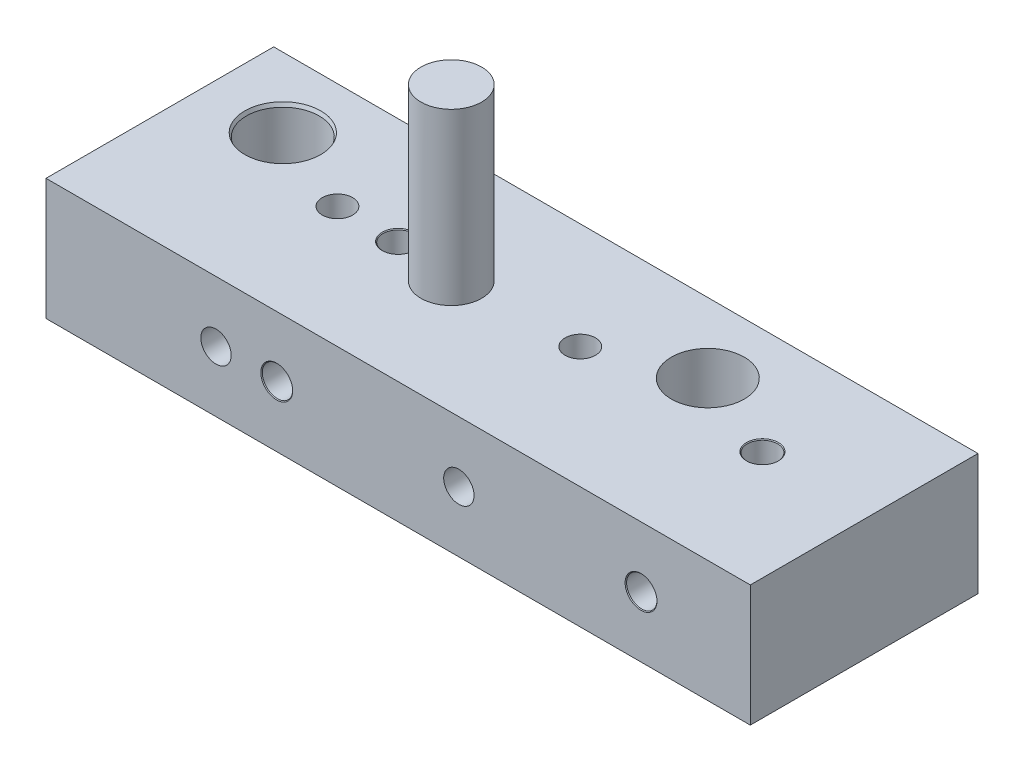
ISO-10303-21;
HEADER;
FILE_DESCRIPTION(('STEP AP214'),'2;1');
FILE_NAME('part.step','',(''),(''),'','','');
FILE_SCHEMA(('AUTOMOTIVE_DESIGN { 1 0 10303 214 1 1 1 1 }'));
ENDSEC;
DATA;
#1=APPLICATION_CONTEXT('core data for automotive mechanical design processes');
#2=APPLICATION_PROTOCOL_DEFINITION('international standard','automotive_design',2000,#1);
#3=PRODUCT_CONTEXT('',#1,'mechanical');
#4=PRODUCT('Part','Part','',(#3));
#5=PRODUCT_RELATED_PRODUCT_CATEGORY('part','',(#4));
#6=PRODUCT_DEFINITION_FORMATION('','',#4);
#7=PRODUCT_DEFINITION_CONTEXT('part definition',#1,'design');
#8=PRODUCT_DEFINITION('design','',#6,#7);
#9=PRODUCT_DEFINITION_SHAPE('','',#8);
#10=(LENGTH_UNIT() NAMED_UNIT(*) SI_UNIT(.MILLI.,.METRE.));
#11=(NAMED_UNIT(*) PLANE_ANGLE_UNIT() SI_UNIT($,.RADIAN.));
#12=(NAMED_UNIT(*) SI_UNIT($,.STERADIAN.) SOLID_ANGLE_UNIT());
#13=UNCERTAINTY_MEASURE_WITH_UNIT(LENGTH_MEASURE(1.E-05),#10,'distance_accuracy_value','');
#14=(GEOMETRIC_REPRESENTATION_CONTEXT(3) GLOBAL_UNCERTAINTY_ASSIGNED_CONTEXT((#13)) GLOBAL_UNIT_ASSIGNED_CONTEXT((#10,
#11,#12)) REPRESENTATION_CONTEXT('',''));
#15=CARTESIAN_POINT('',(0.,0.,0.));
#16=DIRECTION('',(0.,0.,1.));
#17=DIRECTION('',(1.,0.,0.));
#18=AXIS2_PLACEMENT_3D('',#15,#16,#17);
#19=CARTESIAN_POINT('',(0.,20.,-37.5));
#20=DIRECTION('',(0.,-1.,0.));
#21=DIRECTION('',(0.,0.,-1.));
#22=AXIS2_PLACEMENT_3D('',#19,#20,#21);
#23=PLANE('',#22);
#24=CARTESIAN_POINT('',(83.,20.,-26.));
#25=DIRECTION('',(0.,-1.,0.));
#26=DIRECTION('',(0.,0.,-1.));
#27=AXIS2_PLACEMENT_3D('',#24,#25,#26);
#28=CIRCLE('',#27,6.);
#29=CARTESIAN_POINT('',(83.,20.,-32.));
#30=VERTEX_POINT('',#29);
#31=EDGE_CURVE('E9178',#30,#30,#28,.T.);
#32=ORIENTED_EDGE('',*,*,#31,.T.);
#33=EDGE_LOOP('',(#32));
#34=FACE_BOUND('',#33,.T.);
#35=DIRECTION('',(0.,0.,1.));
#36=VECTOR('',#35,1.);
#37=CARTESIAN_POINT('',(0.,20.,0.));
#38=LINE('',#37,#36);
#39=CARTESIAN_POINT('',(0.,20.,-37.5));
#40=VERTEX_POINT('',#39);
#41=CARTESIAN_POINT('',(0.,20.,0.));
#42=VERTEX_POINT('',#41);
#43=EDGE_CURVE('E9306',#40,#42,#38,.T.);
#44=ORIENTED_EDGE('',*,*,#43,.T.);
#45=DIRECTION('',(1.,0.,0.));
#46=VECTOR('',#45,1.);
#47=CARTESIAN_POINT('',(0.,20.,0.));
#48=LINE('',#47,#46);
#49=CARTESIAN_POINT('',(116.,20.,0.));
#50=VERTEX_POINT('',#49);
#51=EDGE_CURVE('E9304',#42,#50,#48,.T.);
#52=ORIENTED_EDGE('',*,*,#51,.T.);
#53=DIRECTION('',(0.,0.,-1.));
#54=VECTOR('',#53,1.);
#55=CARTESIAN_POINT('',(116.,20.,0.));
#56=LINE('',#55,#54);
#57=CARTESIAN_POINT('',(116.,20.,-37.5));
#58=VERTEX_POINT('',#57);
#59=EDGE_CURVE('E9302',#50,#58,#56,.T.);
#60=ORIENTED_EDGE('',*,*,#59,.T.);
#61=DIRECTION('',(-1.,0.,0.));
#62=VECTOR('',#61,1.);
#63=CARTESIAN_POINT('',(0.,20.,-37.5));
#64=LINE('',#63,#62);
#65=EDGE_CURVE('E9300',#58,#40,#64,.T.);
#66=ORIENTED_EDGE('',*,*,#65,.T.);
#67=EDGE_LOOP('',(#44,#52,#60,#66));
#68=FACE_BOUND('',#67,.T.);
#69=CARTESIAN_POINT('',(13.,20.,-26.));
#70=DIRECTION('',(0.,-1.,0.));
#71=DIRECTION('',(0.,0.,-1.));
#72=AXIS2_PLACEMENT_3D('',#69,#70,#71);
#73=CIRCLE('',#72,6.25);
#74=CARTESIAN_POINT('',(13.,20.,-32.25));
#75=VERTEX_POINT('',#74);
#76=EDGE_CURVE('E9327',#75,#75,#73,.T.);
#77=ORIENTED_EDGE('',*,*,#76,.T.);
#78=EDGE_LOOP('',(#77));
#79=FACE_BOUND('',#78,.T.);
#80=CARTESIAN_POINT('',(28.,20.,-20.));
#81=DIRECTION('',(0.,-1.,0.));
#82=DIRECTION('',(0.,0.,-1.));
#83=AXIS2_PLACEMENT_3D('',#80,#81,#82);
#84=CIRCLE('',#83,2.5);
#85=CARTESIAN_POINT('',(28.,20.,-22.5));
#86=VERTEX_POINT('',#85);
#87=EDGE_CURVE('E9333',#86,#86,#84,.T.);
#88=ORIENTED_EDGE('',*,*,#87,.T.);
#89=EDGE_LOOP('',(#88));
#90=FACE_BOUND('',#89,.T.);
#91=CARTESIAN_POINT('',(68.,20.,-20.));
#92=DIRECTION('',(0.,-1.,0.));
#93=DIRECTION('',(0.,0.,-1.));
#94=AXIS2_PLACEMENT_3D('',#91,#92,#93);
#95=CIRCLE('',#94,2.5);
#96=CARTESIAN_POINT('',(68.,20.,-22.5));
#97=VERTEX_POINT('',#96);
#98=EDGE_CURVE('E9339',#97,#97,#95,.T.);
#99=ORIENTED_EDGE('',*,*,#98,.T.);
#100=EDGE_LOOP('',(#99));
#101=FACE_BOUND('',#100,.T.);
#102=CARTESIAN_POINT('',(38.,20.,-20.));
#103=DIRECTION('',(0.,-1.,0.));
#104=DIRECTION('',(0.,0.,-1.));
#105=AXIS2_PLACEMENT_3D('',#102,#103,#104);
#106=CIRCLE('',#105,2.625);
#107=CARTESIAN_POINT('',(38.,20.,-22.625));
#108=VERTEX_POINT('',#107);
#109=EDGE_CURVE('E9351',#108,#108,#106,.T.);
#110=ORIENTED_EDGE('',*,*,#109,.T.);
#111=EDGE_LOOP('',(#110));
#112=FACE_BOUND('',#111,.T.);
#113=CARTESIAN_POINT('',(98.,20.,-20.));
#114=DIRECTION('',(0.,-1.,0.));
#115=DIRECTION('',(0.,0.,-1.));
#116=AXIS2_PLACEMENT_3D('',#113,#114,#115);
#117=CIRCLE('',#116,2.62499999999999);
#118=CARTESIAN_POINT('',(98.,20.,-22.625));
#119=VERTEX_POINT('',#118);
#120=EDGE_CURVE('E9363',#119,#119,#117,.T.);
#121=ORIENTED_EDGE('',*,*,#120,.T.);
#122=EDGE_LOOP('',(#121));
#123=FACE_BOUND('',#122,.T.);
#124=CARTESIAN_POINT('',(48.,20.,-18.75));
#125=DIRECTION('',(0.,-1.,0.));
#126=DIRECTION('',(0.,0.,-1.));
#127=AXIS2_PLACEMENT_3D('',#124,#125,#126);
#128=CIRCLE('',#127,5.);
#129=CARTESIAN_POINT('',(48.,20.,-23.75));
#130=VERTEX_POINT('',#129);
#131=EDGE_CURVE('E11',#130,#130,#128,.F.);
#132=ORIENTED_EDGE('',*,*,#131,.F.);
#133=EDGE_LOOP('',(#132));
#134=FACE_BOUND('',#133,.T.);
#135=ADVANCED_FACE('F9174',(#34,#68,#79,#90,#101,#112,#123,#134),#23,.F.);
#136=CARTESIAN_POINT('',(68.,0.,-20.));
#137=DIRECTION('',(0.,-1.,0.));
#138=DIRECTION('',(0.,0.,-1.));
#139=AXIS2_PLACEMENT_3D('',#136,#137,#138);
#140=CYLINDRICAL_SURFACE('',#139,2.5);
#141=CARTESIAN_POINT('',(68.,0.,-20.));
#142=DIRECTION('',(0.,-1.,0.));
#143=DIRECTION('',(0.,0.,-1.));
#144=AXIS2_PLACEMENT_3D('',#141,#142,#143);
#145=CIRCLE('',#144,2.49999999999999);
#146=CARTESIAN_POINT('',(68.,0.,-22.5));
#147=VERTEX_POINT('',#146);
#148=EDGE_CURVE('E9336',#147,#147,#145,.T.);
#149=ORIENTED_EDGE('',*,*,#148,.T.);
#150=EDGE_LOOP('',(#149));
#151=FACE_BOUND('',#150,.T.);
#152=CARTESIAN_POINT('',(68.,10.,-20.));
#153=DIRECTION('',(0.,-0.707106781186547,-0.707106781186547));
#154=DIRECTION('',(0.,-0.707106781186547,0.707106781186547));
#155=AXIS2_PLACEMENT_3D('',#152,#153,#154);
#156=ELLIPSE('',#155,3.53553390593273,2.49999999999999);
#157=CARTESIAN_POINT('',(65.5,10.,-20.));
#158=VERTEX_POINT('',#157);
#159=CARTESIAN_POINT('',(70.5,10.,-20.));
#160=VERTEX_POINT('',#159);
#161=EDGE_CURVE('E9189',#158,#160,#156,.F.);
#162=ORIENTED_EDGE('',*,*,#161,.T.);
#163=CARTESIAN_POINT('',(68.,10.,-20.));
#164=DIRECTION('',(0.,-0.707106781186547,0.707106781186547));
#165=DIRECTION('',(0.,-0.707106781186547,-0.707106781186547));
#166=AXIS2_PLACEMENT_3D('',#163,#164,#165);
#167=ELLIPSE('',#166,3.53553390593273,2.49999999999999);
#168=EDGE_CURVE('E9183',#160,#158,#167,.F.);
#169=ORIENTED_EDGE('',*,*,#168,.T.);
#170=EDGE_LOOP('',(#162,#169));
#171=FACE_BOUND('',#170,.T.);
#172=ADVANCED_FACE('F9252',(#151,#171),#140,.F.);
#173=CARTESIAN_POINT('',(28.,0.,-20.));
#174=DIRECTION('',(0.,-1.,0.));
#175=DIRECTION('',(0.,0.,-1.));
#176=AXIS2_PLACEMENT_3D('',#173,#174,#175);
#177=CYLINDRICAL_SURFACE('',#176,2.49999999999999);
#178=CARTESIAN_POINT('',(28.,0.,-20.));
#179=DIRECTION('',(0.,-1.,0.));
#180=DIRECTION('',(0.,0.,-1.));
#181=AXIS2_PLACEMENT_3D('',#178,#179,#180);
#182=CIRCLE('',#181,2.49999999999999);
#183=CARTESIAN_POINT('',(28.,0.,-22.5));
#184=VERTEX_POINT('',#183);
#185=EDGE_CURVE('E9330',#184,#184,#182,.T.);
#186=ORIENTED_EDGE('',*,*,#185,.T.);
#187=EDGE_LOOP('',(#186));
#188=FACE_BOUND('',#187,.T.);
#189=CARTESIAN_POINT('',(28.,10.,-20.));
#190=DIRECTION('',(0.,-0.707106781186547,-0.707106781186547));
#191=DIRECTION('',(0.,-0.707106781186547,0.707106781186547));
#192=AXIS2_PLACEMENT_3D('',#189,#190,#191);
#193=ELLIPSE('',#192,3.53553390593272,2.49999999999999);
#194=CARTESIAN_POINT('',(25.5,10.,-20.));
#195=VERTEX_POINT('',#194);
#196=CARTESIAN_POINT('',(30.5,10.,-20.));
#197=VERTEX_POINT('',#196);
#198=EDGE_CURVE('E9196',#195,#197,#193,.F.);
#199=ORIENTED_EDGE('',*,*,#198,.T.);
#200=CARTESIAN_POINT('',(28.,10.,-20.));
#201=DIRECTION('',(0.,-0.707106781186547,0.707106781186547));
#202=DIRECTION('',(0.,-0.707106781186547,-0.707106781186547));
#203=AXIS2_PLACEMENT_3D('',#200,#201,#202);
#204=ELLIPSE('',#203,3.53553390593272,2.49999999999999);
#205=EDGE_CURVE('E9250',#197,#195,#204,.F.);
#206=ORIENTED_EDGE('',*,*,#205,.T.);
#207=EDGE_LOOP('',(#199,#206));
#208=FACE_BOUND('',#207,.T.);
#209=ADVANCED_FACE('F9544',(#188,#208),#177,.F.);
#210=CARTESIAN_POINT('',(98.,0.,-20.));
#211=DIRECTION('',(0.,-1.,0.));
#212=DIRECTION('',(0.,0.,-1.));
#213=AXIS2_PLACEMENT_3D('',#210,#211,#212);
#214=CYLINDRICAL_SURFACE('',#213,2.5);
#215=CARTESIAN_POINT('',(98.,0.125000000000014,-20.));
#216=DIRECTION('',(0.,-1.,0.));
#217=DIRECTION('',(0.,0.,-1.));
#218=AXIS2_PLACEMENT_3D('',#215,#216,#217);
#219=CIRCLE('',#218,2.49999999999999);
#220=CARTESIAN_POINT('',(98.,0.125000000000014,-22.5));
#221=VERTEX_POINT('',#220);
#222=EDGE_CURVE('E9357',#221,#221,#219,.T.);
#223=ORIENTED_EDGE('',*,*,#222,.T.);
#224=EDGE_LOOP('',(#223));
#225=FACE_BOUND('',#224,.T.);
#226=CARTESIAN_POINT('',(98.,10.,-20.));
#227=DIRECTION('',(0.,-0.707106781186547,-0.707106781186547));
#228=DIRECTION('',(0.,-0.707106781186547,0.707106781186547));
#229=AXIS2_PLACEMENT_3D('',#226,#227,#228);
#230=ELLIPSE('',#229,3.53553390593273,2.5);
#231=CARTESIAN_POINT('',(95.5,10.,-20.));
#232=VERTEX_POINT('',#231);
#233=CARTESIAN_POINT('',(100.5,10.,-20.));
#234=VERTEX_POINT('',#233);
#235=EDGE_CURVE('E9275',#232,#234,#230,.F.);
#236=ORIENTED_EDGE('',*,*,#235,.T.);
#237=CARTESIAN_POINT('',(98.,10.,-20.));
#238=DIRECTION('',(0.,-0.707106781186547,0.707106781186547));
#239=DIRECTION('',(0.,-0.707106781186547,-0.707106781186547));
#240=AXIS2_PLACEMENT_3D('',#237,#238,#239);
#241=ELLIPSE('',#240,3.53553390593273,2.5);
#242=EDGE_CURVE('E9266',#234,#232,#241,.F.);
#243=ORIENTED_EDGE('',*,*,#242,.T.);
#244=EDGE_LOOP('',(#236,#243));
#245=FACE_BOUND('',#244,.T.);
#246=ADVANCED_FACE('F9520',(#225,#245),#214,.F.);
#247=CARTESIAN_POINT('',(38.,0.,-20.));
#248=DIRECTION('',(0.,-1.,0.));
#249=DIRECTION('',(0.,0.,-1.));
#250=AXIS2_PLACEMENT_3D('',#247,#248,#249);
#251=CYLINDRICAL_SURFACE('',#250,2.5);
#252=CARTESIAN_POINT('',(38.,0.125,-20.));
#253=DIRECTION('',(0.,-1.,0.));
#254=DIRECTION('',(0.,0.,-1.));
#255=AXIS2_PLACEMENT_3D('',#252,#253,#254);
#256=CIRCLE('',#255,2.5);
#257=CARTESIAN_POINT('',(38.,0.125,-22.5));
#258=VERTEX_POINT('',#257);
#259=EDGE_CURVE('E9345',#258,#258,#256,.T.);
#260=ORIENTED_EDGE('',*,*,#259,.T.);
#261=EDGE_LOOP('',(#260));
#262=FACE_BOUND('',#261,.T.);
#263=CARTESIAN_POINT('',(38.,10.,-20.));
#264=DIRECTION('',(0.,-0.707106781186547,-0.707106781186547));
#265=DIRECTION('',(0.,-0.707106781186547,0.707106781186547));
#266=AXIS2_PLACEMENT_3D('',#263,#264,#265);
#267=ELLIPSE('',#266,3.53553390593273,2.49999999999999);
#268=CARTESIAN_POINT('',(35.5,10.,-20.));
#269=VERTEX_POINT('',#268);
#270=CARTESIAN_POINT('',(40.5,10.,-20.));
#271=VERTEX_POINT('',#270);
#272=EDGE_CURVE('E9286',#269,#271,#267,.F.);
#273=ORIENTED_EDGE('',*,*,#272,.T.);
#274=CARTESIAN_POINT('',(38.,10.,-20.));
#275=DIRECTION('',(0.,-0.707106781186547,0.707106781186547));
#276=DIRECTION('',(0.,-0.707106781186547,-0.707106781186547));
#277=AXIS2_PLACEMENT_3D('',#274,#275,#276);
#278=ELLIPSE('',#277,3.53553390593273,2.49999999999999);
#279=EDGE_CURVE('E9277',#271,#269,#278,.F.);
#280=ORIENTED_EDGE('',*,*,#279,.T.);
#281=EDGE_LOOP('',(#273,#280));
#282=FACE_BOUND('',#281,.T.);
#283=ADVANCED_FACE('F9533',(#262,#282),#251,.F.);
#284=CARTESIAN_POINT('',(0.,20.,0.));
#285=DIRECTION('',(1.,0.,0.));
#286=DIRECTION('',(0.,0.,-1.));
#287=AXIS2_PLACEMENT_3D('',#284,#285,#286);
#288=PLANE('',#287);
#289=DIRECTION('',(0.,0.,1.));
#290=VECTOR('',#289,1.);
#291=CARTESIAN_POINT('',(0.,0.,0.));
#292=LINE('',#291,#290);
#293=CARTESIAN_POINT('',(0.,0.,-37.5));
#294=VERTEX_POINT('',#293);
#295=CARTESIAN_POINT('',(0.,0.,0.));
#296=VERTEX_POINT('',#295);
#297=EDGE_CURVE('E9315',#294,#296,#292,.T.);
#298=ORIENTED_EDGE('',*,*,#297,.T.);
#299=DIRECTION('',(0.,-1.,0.));
#300=VECTOR('',#299,1.);
#301=CARTESIAN_POINT('',(0.,20.,0.));
#302=LINE('',#301,#300);
#303=EDGE_CURVE('E9288',#42,#296,#302,.T.);
#304=ORIENTED_EDGE('',*,*,#303,.F.);
#305=ORIENTED_EDGE('',*,*,#43,.F.);
#306=DIRECTION('',(0.,-1.,0.));
#307=VECTOR('',#306,1.);
#308=CARTESIAN_POINT('',(0.,20.,-37.5));
#309=LINE('',#308,#307);
#310=EDGE_CURVE('E9297',#40,#294,#309,.T.);
#311=ORIENTED_EDGE('',*,*,#310,.T.);
#312=EDGE_LOOP('',(#298,#304,#305,#311));
#313=FACE_BOUND('',#312,.T.);
#314=ADVANCED_FACE('F9176',(#313),#288,.F.);
#315=CARTESIAN_POINT('',(0.,20.,0.));
#316=DIRECTION('',(0.,0.,-1.));
#317=DIRECTION('',(-1.,0.,0.));
#318=AXIS2_PLACEMENT_3D('',#315,#316,#317);
#319=PLANE('',#318);
#320=CARTESIAN_POINT('',(68.,10.,0.));
#321=DIRECTION('',(0.,0.,1.));
#322=DIRECTION('',(1.,0.,0.));
#323=AXIS2_PLACEMENT_3D('',#320,#321,#322);
#324=CIRCLE('',#323,2.49999999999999);
#325=CARTESIAN_POINT('',(70.5,10.,0.));
#326=VERTEX_POINT('',#325);
#327=EDGE_CURVE('E9396',#326,#326,#324,.T.);
#328=ORIENTED_EDGE('',*,*,#327,.F.);
#329=EDGE_LOOP('',(#328));
#330=FACE_BOUND('',#329,.T.);
#331=CARTESIAN_POINT('',(28.,10.,0.));
#332=DIRECTION('',(0.,0.,1.));
#333=DIRECTION('',(1.,0.,0.));
#334=AXIS2_PLACEMENT_3D('',#331,#332,#333);
#335=CIRCLE('',#334,2.49999999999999);
#336=CARTESIAN_POINT('',(30.5,10.,0.));
#337=VERTEX_POINT('',#336);
#338=EDGE_CURVE('E9390',#337,#337,#335,.T.);
#339=ORIENTED_EDGE('',*,*,#338,.F.);
#340=EDGE_LOOP('',(#339));
#341=FACE_BOUND('',#340,.T.);
#342=CARTESIAN_POINT('',(98.,10.,0.));
#343=DIRECTION('',(0.,0.,1.));
#344=DIRECTION('',(1.,0.,0.));
#345=AXIS2_PLACEMENT_3D('',#342,#343,#344);
#346=CIRCLE('',#345,2.625);
#347=CARTESIAN_POINT('',(100.625,10.,0.));
#348=VERTEX_POINT('',#347);
#349=EDGE_CURVE('E9378',#348,#348,#346,.T.);
#350=ORIENTED_EDGE('',*,*,#349,.F.);
#351=EDGE_LOOP('',(#350));
#352=FACE_BOUND('',#351,.T.);
#353=CARTESIAN_POINT('',(38.,10.,0.));
#354=DIRECTION('',(0.,0.,1.));
#355=DIRECTION('',(1.,0.,0.));
#356=AXIS2_PLACEMENT_3D('',#353,#354,#355);
#357=CIRCLE('',#356,2.625);
#358=CARTESIAN_POINT('',(40.625,10.,0.));
#359=VERTEX_POINT('',#358);
#360=EDGE_CURVE('E9366',#359,#359,#357,.T.);
#361=ORIENTED_EDGE('',*,*,#360,.F.);
#362=EDGE_LOOP('',(#361));
#363=FACE_BOUND('',#362,.T.);
#364=DIRECTION('',(1.,0.,0.));
#365=VECTOR('',#364,1.);
#366=CARTESIAN_POINT('',(0.,0.,0.));
#367=LINE('',#366,#365);
#368=CARTESIAN_POINT('',(116.,0.,0.));
#369=VERTEX_POINT('',#368);
#370=EDGE_CURVE('E9313',#296,#369,#367,.T.);
#371=ORIENTED_EDGE('',*,*,#370,.T.);
#372=DIRECTION('',(0.,-1.,0.));
#373=VECTOR('',#372,1.);
#374=CARTESIAN_POINT('',(116.,20.,0.));
#375=LINE('',#374,#373);
#376=EDGE_CURVE('E9291',#50,#369,#375,.T.);
#377=ORIENTED_EDGE('',*,*,#376,.F.);
#378=ORIENTED_EDGE('',*,*,#51,.F.);
#379=ORIENTED_EDGE('',*,*,#303,.T.);
#380=EDGE_LOOP('',(#371,#377,#378,#379));
#381=FACE_BOUND('',#380,.T.);
#382=ADVANCED_FACE('F9445',(#330,#341,#352,#363,#381),#319,.F.);
#383=CARTESIAN_POINT('',(116.,20.,0.));
#384=DIRECTION('',(-1.,0.,0.));
#385=DIRECTION('',(0.,0.,1.));
#386=AXIS2_PLACEMENT_3D('',#383,#384,#385);
#387=PLANE('',#386);
#388=DIRECTION('',(0.,0.,-1.));
#389=VECTOR('',#388,1.);
#390=CARTESIAN_POINT('',(116.,0.,0.));
#391=LINE('',#390,#389);
#392=CARTESIAN_POINT('',(116.,0.,-37.5));
#393=VERTEX_POINT('',#392);
#394=EDGE_CURVE('E9311',#369,#393,#391,.T.);
#395=ORIENTED_EDGE('',*,*,#394,.T.);
#396=DIRECTION('',(0.,-1.,0.));
#397=VECTOR('',#396,1.);
#398=CARTESIAN_POINT('',(116.,20.,-37.5));
#399=LINE('',#398,#397);
#400=EDGE_CURVE('E9294',#58,#393,#399,.T.);
#401=ORIENTED_EDGE('',*,*,#400,.F.);
#402=ORIENTED_EDGE('',*,*,#59,.F.);
#403=ORIENTED_EDGE('',*,*,#376,.T.);
#404=EDGE_LOOP('',(#395,#401,#402,#403));
#405=FACE_BOUND('',#404,.T.);
#406=ADVANCED_FACE('F9442',(#405),#387,.F.);
#407=CARTESIAN_POINT('',(0.,20.,-37.5));
#408=DIRECTION('',(0.,0.,1.));
#409=DIRECTION('',(1.,0.,0.));
#410=AXIS2_PLACEMENT_3D('',#407,#408,#409);
#411=PLANE('',#410);
#412=CARTESIAN_POINT('',(68.,10.,-37.5));
#413=DIRECTION('',(0.,0.,1.));
#414=DIRECTION('',(1.,0.,0.));
#415=AXIS2_PLACEMENT_3D('',#412,#413,#414);
#416=CIRCLE('',#415,2.49999999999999);
#417=CARTESIAN_POINT('',(70.5,10.,-37.5));
#418=VERTEX_POINT('',#417);
#419=EDGE_CURVE('E9399',#418,#418,#416,.T.);
#420=ORIENTED_EDGE('',*,*,#419,.T.);
#421=EDGE_LOOP('',(#420));
#422=FACE_BOUND('',#421,.T.);
#423=CARTESIAN_POINT('',(28.,10.,-37.5));
#424=DIRECTION('',(0.,0.,1.));
#425=DIRECTION('',(1.,0.,0.));
#426=AXIS2_PLACEMENT_3D('',#423,#424,#425);
#427=CIRCLE('',#426,2.49999999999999);
#428=CARTESIAN_POINT('',(30.5,10.,-37.5));
#429=VERTEX_POINT('',#428);
#430=EDGE_CURVE('E9393',#429,#429,#427,.T.);
#431=ORIENTED_EDGE('',*,*,#430,.T.);
#432=EDGE_LOOP('',(#431));
#433=FACE_BOUND('',#432,.T.);
#434=CARTESIAN_POINT('',(98.,10.,-37.5));
#435=DIRECTION('',(0.,0.,1.));
#436=DIRECTION('',(1.,0.,0.));
#437=AXIS2_PLACEMENT_3D('',#434,#435,#436);
#438=CIRCLE('',#437,2.62499999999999);
#439=CARTESIAN_POINT('',(100.625,10.,-37.5));
#440=VERTEX_POINT('',#439);
#441=EDGE_CURVE('E9387',#440,#440,#438,.T.);
#442=ORIENTED_EDGE('',*,*,#441,.T.);
#443=EDGE_LOOP('',(#442));
#444=FACE_BOUND('',#443,.T.);
#445=CARTESIAN_POINT('',(38.,10.,-37.5));
#446=DIRECTION('',(0.,0.,1.));
#447=DIRECTION('',(1.,0.,0.));
#448=AXIS2_PLACEMENT_3D('',#445,#446,#447);
#449=CIRCLE('',#448,2.62499999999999);
#450=CARTESIAN_POINT('',(40.625,10.,-37.5));
#451=VERTEX_POINT('',#450);
#452=EDGE_CURVE('E9375',#451,#451,#449,.T.);
#453=ORIENTED_EDGE('',*,*,#452,.T.);
#454=EDGE_LOOP('',(#453));
#455=FACE_BOUND('',#454,.T.);
#456=DIRECTION('',(-1.,0.,0.));
#457=VECTOR('',#456,1.);
#458=CARTESIAN_POINT('',(0.,0.,-37.5));
#459=LINE('',#458,#457);
#460=EDGE_CURVE('E9309',#393,#294,#459,.T.);
#461=ORIENTED_EDGE('',*,*,#460,.T.);
#462=ORIENTED_EDGE('',*,*,#310,.F.);
#463=ORIENTED_EDGE('',*,*,#65,.F.);
#464=ORIENTED_EDGE('',*,*,#400,.T.);
#465=EDGE_LOOP('',(#461,#462,#463,#464));
#466=FACE_BOUND('',#465,.T.);
#467=ADVANCED_FACE('F9418',(#422,#433,#444,#455,#466),#411,.F.);
#468=CARTESIAN_POINT('',(0.,0.,-37.5));
#469=DIRECTION('',(0.,-1.,0.));
#470=DIRECTION('',(0.,0.,-1.));
#471=AXIS2_PLACEMENT_3D('',#468,#469,#470);
#472=PLANE('',#471);
#473=CARTESIAN_POINT('',(83.,0.,-26.));
#474=DIRECTION('',(0.,-1.,0.));
#475=DIRECTION('',(0.,0.,-1.));
#476=AXIS2_PLACEMENT_3D('',#473,#474,#475);
#477=CIRCLE('',#476,6.25000000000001);
#478=CARTESIAN_POINT('',(83.,0.,-32.25));
#479=VERTEX_POINT('',#478);
#480=EDGE_CURVE('E9408',#479,#479,#477,.T.);
#481=ORIENTED_EDGE('',*,*,#480,.F.);
#482=EDGE_LOOP('',(#481));
#483=FACE_BOUND('',#482,.T.);
#484=CARTESIAN_POINT('',(98.,0.,-20.));
#485=DIRECTION('',(0.,-1.,0.));
#486=DIRECTION('',(0.,0.,-1.));
#487=AXIS2_PLACEMENT_3D('',#484,#485,#486);
#488=CIRCLE('',#487,2.625);
#489=CARTESIAN_POINT('',(98.,0.,-22.625));
#490=VERTEX_POINT('',#489);
#491=EDGE_CURVE('E9354',#490,#490,#488,.T.);
#492=ORIENTED_EDGE('',*,*,#491,.F.);
#493=EDGE_LOOP('',(#492));
#494=FACE_BOUND('',#493,.T.);
#495=CARTESIAN_POINT('',(38.,0.,-20.));
#496=DIRECTION('',(0.,-1.,0.));
#497=DIRECTION('',(0.,0.,-1.));
#498=AXIS2_PLACEMENT_3D('',#495,#496,#497);
#499=CIRCLE('',#498,2.625);
#500=CARTESIAN_POINT('',(38.,0.,-22.625));
#501=VERTEX_POINT('',#500);
#502=EDGE_CURVE('E9342',#501,#501,#499,.T.);
#503=ORIENTED_EDGE('',*,*,#502,.F.);
#504=EDGE_LOOP('',(#503));
#505=FACE_BOUND('',#504,.T.);
#506=ORIENTED_EDGE('',*,*,#148,.F.);
#507=EDGE_LOOP('',(#506));
#508=FACE_BOUND('',#507,.T.);
#509=ORIENTED_EDGE('',*,*,#185,.F.);
#510=EDGE_LOOP('',(#509));
#511=FACE_BOUND('',#510,.T.);
#512=CARTESIAN_POINT('',(13.,0.,-26.));
#513=DIRECTION('',(0.,-1.,0.));
#514=DIRECTION('',(0.,0.,-1.));
#515=AXIS2_PLACEMENT_3D('',#512,#513,#514);
#516=CIRCLE('',#515,6.25);
#517=CARTESIAN_POINT('',(13.,0.,-32.25));
#518=VERTEX_POINT('',#517);
#519=EDGE_CURVE('E9318',#518,#518,#516,.T.);
#520=ORIENTED_EDGE('',*,*,#519,.F.);
#521=EDGE_LOOP('',(#520));
#522=FACE_BOUND('',#521,.T.);
#523=ORIENTED_EDGE('',*,*,#297,.F.);
#524=ORIENTED_EDGE('',*,*,#460,.F.);
#525=ORIENTED_EDGE('',*,*,#394,.F.);
#526=ORIENTED_EDGE('',*,*,#370,.F.);
#527=EDGE_LOOP('',(#523,#524,#525,#526));
#528=FACE_BOUND('',#527,.T.);
#529=ADVANCED_FACE('F9414',(#483,#494,#505,#508,#511,#522,#528),#472,.T.);
#530=CARTESIAN_POINT('',(13.,0.,-26.));
#531=DIRECTION('',(0.,-1.,0.));
#532=DIRECTION('',(0.,0.,-1.));
#533=AXIS2_PLACEMENT_3D('',#530,#531,#532);
#534=CONICAL_SURFACE('',#533,6.25,0.392699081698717);
#535=CARTESIAN_POINT('',(13.,0.603553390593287,-26.));
#536=DIRECTION('',(0.,-1.,0.));
#537=DIRECTION('',(0.,0.,-1.));
#538=AXIS2_PLACEMENT_3D('',#535,#536,#537);
#539=CIRCLE('',#538,6.);
#540=CARTESIAN_POINT('',(13.,0.603553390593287,-32.));
#541=VERTEX_POINT('',#540);
#542=EDGE_CURVE('E9321',#541,#541,#539,.T.);
#543=ORIENTED_EDGE('',*,*,#542,.F.);
#544=EDGE_LOOP('',(#543));
#545=FACE_BOUND('',#544,.T.);
#546=ORIENTED_EDGE('',*,*,#519,.T.);
#547=EDGE_LOOP('',(#546));
#548=FACE_BOUND('',#547,.T.);
#549=ADVANCED_FACE('F9417',(#545,#548),#534,.F.);
#550=CARTESIAN_POINT('',(13.,0.,-26.));
#551=DIRECTION('',(0.,-1.,0.));
#552=DIRECTION('',(0.,0.,-1.));
#553=AXIS2_PLACEMENT_3D('',#550,#551,#552);
#554=CYLINDRICAL_SURFACE('',#553,6.);
#555=CARTESIAN_POINT('',(13.,19.3964466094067,-26.));
#556=DIRECTION('',(0.,-1.,0.));
#557=DIRECTION('',(0.,0.,-1.));
#558=AXIS2_PLACEMENT_3D('',#555,#556,#557);
#559=CIRCLE('',#558,5.99999999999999);
#560=CARTESIAN_POINT('',(13.,19.3964466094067,-32.));
#561=VERTEX_POINT('',#560);
#562=EDGE_CURVE('E9324',#561,#561,#559,.T.);
#563=ORIENTED_EDGE('',*,*,#562,.F.);
#564=EDGE_LOOP('',(#563));
#565=FACE_BOUND('',#564,.T.);
#566=ORIENTED_EDGE('',*,*,#542,.T.);
#567=EDGE_LOOP('',(#566));
#568=FACE_BOUND('',#567,.T.);
#569=ADVANCED_FACE('F9547',(#565,#568),#554,.F.);
#570=CARTESIAN_POINT('',(13.,19.3964466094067,-26.));
#571=DIRECTION('',(0.,1.,0.));
#572=DIRECTION('',(0.,0.,1.));
#573=AXIS2_PLACEMENT_3D('',#570,#571,#572);
#574=CONICAL_SURFACE('',#573,5.99999999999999,0.392699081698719);
#575=ORIENTED_EDGE('',*,*,#76,.F.);
#576=EDGE_LOOP('',(#575));
#577=FACE_BOUND('',#576,.T.);
#578=ORIENTED_EDGE('',*,*,#562,.T.);
#579=EDGE_LOOP('',(#578));
#580=FACE_BOUND('',#579,.T.);
#581=ADVANCED_FACE('F9542',(#577,#580),#574,.F.);
#582=CARTESIAN_POINT('',(28.,10.,-20.));
#583=DIRECTION('',(0.,-0.707106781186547,-0.707106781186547));
#584=DIRECTION('',(0.,-0.707106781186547,0.707106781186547));
#585=AXIS2_PLACEMENT_3D('',#582,#583,#584);
#586=ELLIPSE('',#585,3.53553390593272,2.49999999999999);
#587=EDGE_CURVE('E9262',#195,#197,#586,.T.);
#588=ORIENTED_EDGE('',*,*,#587,.T.);
#589=CARTESIAN_POINT('',(28.,10.,-20.));
#590=DIRECTION('',(0.,-0.707106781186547,0.707106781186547));
#591=DIRECTION('',(0.,-0.707106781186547,-0.707106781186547));
#592=AXIS2_PLACEMENT_3D('',#589,#590,#591);
#593=ELLIPSE('',#592,3.53553390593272,2.49999999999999);
#594=EDGE_CURVE('E9259',#197,#195,#593,.T.);
#595=ORIENTED_EDGE('',*,*,#594,.T.);
#596=EDGE_LOOP('',(#588,#595));
#597=FACE_BOUND('',#596,.T.);
#598=ORIENTED_EDGE('',*,*,#87,.F.);
#599=EDGE_LOOP('',(#598));
#600=FACE_BOUND('',#599,.T.);
#601=ADVANCED_FACE('F9539',(#597,#600),#177,.F.);
#602=CARTESIAN_POINT('',(68.,10.,-20.));
#603=DIRECTION('',(0.,-0.707106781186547,-0.707106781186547));
#604=DIRECTION('',(0.,-0.707106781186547,0.707106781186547));
#605=AXIS2_PLACEMENT_3D('',#602,#603,#604);
#606=ELLIPSE('',#605,3.53553390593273,2.49999999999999);
#607=EDGE_CURVE('E9242',#158,#160,#606,.T.);
#608=ORIENTED_EDGE('',*,*,#607,.T.);
#609=CARTESIAN_POINT('',(68.,10.,-20.));
#610=DIRECTION('',(0.,-0.707106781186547,0.707106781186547));
#611=DIRECTION('',(0.,-0.707106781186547,-0.707106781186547));
#612=AXIS2_PLACEMENT_3D('',#609,#610,#611);
#613=ELLIPSE('',#612,3.53553390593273,2.49999999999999);
#614=EDGE_CURVE('E9246',#160,#158,#613,.T.);
#615=ORIENTED_EDGE('',*,*,#614,.T.);
#616=EDGE_LOOP('',(#608,#615));
#617=FACE_BOUND('',#616,.T.);
#618=ORIENTED_EDGE('',*,*,#98,.F.);
#619=EDGE_LOOP('',(#618));
#620=FACE_BOUND('',#619,.T.);
#621=ADVANCED_FACE('F9254',(#617,#620),#140,.F.);
#622=CARTESIAN_POINT('',(38.,0.,-20.));
#623=DIRECTION('',(0.,-1.,0.));
#624=DIRECTION('',(0.,0.,-1.));
#625=AXIS2_PLACEMENT_3D('',#622,#623,#624);
#626=CONICAL_SURFACE('',#625,2.625,0.785398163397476);
#627=ORIENTED_EDGE('',*,*,#259,.F.);
#628=EDGE_LOOP('',(#627));
#629=FACE_BOUND('',#628,.T.);
#630=ORIENTED_EDGE('',*,*,#502,.T.);
#631=EDGE_LOOP('',(#630));
#632=FACE_BOUND('',#631,.T.);
#633=ADVANCED_FACE('F9531',(#629,#632),#626,.F.);
#634=CARTESIAN_POINT('',(38.,10.,-20.));
#635=DIRECTION('',(0.,-0.707106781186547,-0.707106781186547));
#636=DIRECTION('',(0.,-0.707106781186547,0.707106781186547));
#637=AXIS2_PLACEMENT_3D('',#634,#635,#636);
#638=ELLIPSE('',#637,3.53553390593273,2.49999999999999);
#639=EDGE_CURVE('E9283',#269,#271,#638,.T.);
#640=ORIENTED_EDGE('',*,*,#639,.T.);
#641=CARTESIAN_POINT('',(38.,10.,-20.));
#642=DIRECTION('',(0.,-0.707106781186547,0.707106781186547));
#643=DIRECTION('',(0.,-0.707106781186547,-0.707106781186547));
#644=AXIS2_PLACEMENT_3D('',#641,#642,#643);
#645=ELLIPSE('',#644,3.53553390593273,2.49999999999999);
#646=EDGE_CURVE('E9280',#271,#269,#645,.T.);
#647=ORIENTED_EDGE('',*,*,#646,.T.);
#648=EDGE_LOOP('',(#640,#647));
#649=FACE_BOUND('',#648,.T.);
#650=CARTESIAN_POINT('',(38.,19.875,-20.));
#651=DIRECTION('',(0.,-1.,0.));
#652=DIRECTION('',(0.,0.,-1.));
#653=AXIS2_PLACEMENT_3D('',#650,#651,#652);
#654=CIRCLE('',#653,2.5);
#655=CARTESIAN_POINT('',(38.,19.875,-22.5));
#656=VERTEX_POINT('',#655);
#657=EDGE_CURVE('E9348',#656,#656,#654,.T.);
#658=ORIENTED_EDGE('',*,*,#657,.F.);
#659=EDGE_LOOP('',(#658));
#660=FACE_BOUND('',#659,.T.);
#661=ADVANCED_FACE('F9527',(#649,#660),#251,.F.);
#662=CARTESIAN_POINT('',(38.,19.875,-20.));
#663=DIRECTION('',(0.,1.,0.));
#664=DIRECTION('',(0.,0.,1.));
#665=AXIS2_PLACEMENT_3D('',#662,#663,#664);
#666=CONICAL_SURFACE('',#665,2.5,0.785398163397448);
#667=ORIENTED_EDGE('',*,*,#109,.F.);
#668=EDGE_LOOP('',(#667));
#669=FACE_BOUND('',#668,.T.);
#670=ORIENTED_EDGE('',*,*,#657,.T.);
#671=EDGE_LOOP('',(#670));
#672=FACE_BOUND('',#671,.T.);
#673=ADVANCED_FACE('F9523',(#669,#672),#666,.F.);
#674=CARTESIAN_POINT('',(98.,0.,-20.));
#675=DIRECTION('',(0.,-1.,0.));
#676=DIRECTION('',(0.,0.,-1.));
#677=AXIS2_PLACEMENT_3D('',#674,#675,#676);
#678=CONICAL_SURFACE('',#677,2.625,0.785398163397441);
#679=ORIENTED_EDGE('',*,*,#222,.F.);
#680=EDGE_LOOP('',(#679));
#681=FACE_BOUND('',#680,.T.);
#682=ORIENTED_EDGE('',*,*,#491,.T.);
#683=EDGE_LOOP('',(#682));
#684=FACE_BOUND('',#683,.T.);
#685=ADVANCED_FACE('F9518',(#681,#684),#678,.F.);
#686=CARTESIAN_POINT('',(98.,10.,-20.));
#687=DIRECTION('',(0.,-0.707106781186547,-0.707106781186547));
#688=DIRECTION('',(0.,-0.707106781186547,0.707106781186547));
#689=AXIS2_PLACEMENT_3D('',#686,#687,#688);
#690=ELLIPSE('',#689,3.53553390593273,2.5);
#691=EDGE_CURVE('E9272',#232,#234,#690,.T.);
#692=ORIENTED_EDGE('',*,*,#691,.T.);
#693=CARTESIAN_POINT('',(98.,10.,-20.));
#694=DIRECTION('',(0.,-0.707106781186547,0.707106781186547));
#695=DIRECTION('',(0.,-0.707106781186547,-0.707106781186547));
#696=AXIS2_PLACEMENT_3D('',#693,#694,#695);
#697=ELLIPSE('',#696,3.53553390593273,2.5);
#698=EDGE_CURVE('E9269',#234,#232,#697,.T.);
#699=ORIENTED_EDGE('',*,*,#698,.T.);
#700=EDGE_LOOP('',(#692,#699));
#701=FACE_BOUND('',#700,.T.);
#702=CARTESIAN_POINT('',(98.,19.875,-20.));
#703=DIRECTION('',(0.,-1.,0.));
#704=DIRECTION('',(0.,0.,-1.));
#705=AXIS2_PLACEMENT_3D('',#702,#703,#704);
#706=CIRCLE('',#705,2.5);
#707=CARTESIAN_POINT('',(98.,19.875,-22.5));
#708=VERTEX_POINT('',#707);
#709=EDGE_CURVE('E9360',#708,#708,#706,.T.);
#710=ORIENTED_EDGE('',*,*,#709,.F.);
#711=EDGE_LOOP('',(#710));
#712=FACE_BOUND('',#711,.T.);
#713=ADVANCED_FACE('F9514',(#701,#712),#214,.F.);
#714=CARTESIAN_POINT('',(98.,19.875,-20.));
#715=DIRECTION('',(0.,1.,0.));
#716=DIRECTION('',(0.,0.,1.));
#717=AXIS2_PLACEMENT_3D('',#714,#715,#716);
#718=CONICAL_SURFACE('',#717,2.5,0.785398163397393);
#719=ORIENTED_EDGE('',*,*,#120,.F.);
#720=EDGE_LOOP('',(#719));
#721=FACE_BOUND('',#720,.T.);
#722=ORIENTED_EDGE('',*,*,#709,.T.);
#723=EDGE_LOOP('',(#722));
#724=FACE_BOUND('',#723,.T.);
#725=ADVANCED_FACE('F9511',(#721,#724),#718,.F.);
#726=CARTESIAN_POINT('',(38.,10.,0.));
#727=DIRECTION('',(0.,0.,1.));
#728=DIRECTION('',(1.,0.,0.));
#729=AXIS2_PLACEMENT_3D('',#726,#727,#728);
#730=CYLINDRICAL_SURFACE('',#729,2.49999999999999);
#731=CARTESIAN_POINT('',(38.,10.,-0.125000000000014));
#732=DIRECTION('',(0.,0.,1.));
#733=DIRECTION('',(1.,0.,0.));
#734=AXIS2_PLACEMENT_3D('',#731,#732,#733);
#735=CIRCLE('',#734,2.49999999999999);
#736=CARTESIAN_POINT('',(40.5,10.,-0.125000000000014));
#737=VERTEX_POINT('',#736);
#738=EDGE_CURVE('E9369',#737,#737,#735,.T.);
#739=ORIENTED_EDGE('',*,*,#738,.T.);
#740=EDGE_LOOP('',(#739));
#741=FACE_BOUND('',#740,.T.);
#742=ORIENTED_EDGE('',*,*,#272,.F.);
#743=ORIENTED_EDGE('',*,*,#646,.F.);
#744=EDGE_LOOP('',(#742,#743));
#745=FACE_BOUND('',#744,.T.);
#746=ADVANCED_FACE('F9507',(#741,#745),#730,.F.);
#747=CARTESIAN_POINT('',(38.,10.,0.));
#748=DIRECTION('',(0.,0.,1.));
#749=DIRECTION('',(1.,0.,0.));
#750=AXIS2_PLACEMENT_3D('',#747,#748,#749);
#751=CONICAL_SURFACE('',#750,2.625,0.785398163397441);
#752=ORIENTED_EDGE('',*,*,#738,.F.);
#753=EDGE_LOOP('',(#752));
#754=FACE_BOUND('',#753,.T.);
#755=ORIENTED_EDGE('',*,*,#360,.T.);
#756=EDGE_LOOP('',(#755));
#757=FACE_BOUND('',#756,.T.);
#758=ADVANCED_FACE('F9505',(#754,#757),#751,.F.);
#759=CARTESIAN_POINT('',(38.,10.,-37.375));
#760=DIRECTION('',(0.,0.,1.));
#761=DIRECTION('',(1.,0.,0.));
#762=AXIS2_PLACEMENT_3D('',#759,#760,#761);
#763=CIRCLE('',#762,2.5);
#764=CARTESIAN_POINT('',(40.5,10.,-37.375));
#765=VERTEX_POINT('',#764);
#766=EDGE_CURVE('E9372',#765,#765,#763,.T.);
#767=ORIENTED_EDGE('',*,*,#766,.F.);
#768=EDGE_LOOP('',(#767));
#769=FACE_BOUND('',#768,.T.);
#770=ORIENTED_EDGE('',*,*,#639,.F.);
#771=ORIENTED_EDGE('',*,*,#279,.F.);
#772=EDGE_LOOP('',(#770,#771));
#773=FACE_BOUND('',#772,.T.);
#774=ADVANCED_FACE('F9501',(#769,#773),#730,.F.);
#775=CARTESIAN_POINT('',(38.,10.,-37.375));
#776=DIRECTION('',(0.,0.,-1.));
#777=DIRECTION('',(-1.,0.,0.));
#778=AXIS2_PLACEMENT_3D('',#775,#776,#777);
#779=CONICAL_SURFACE('',#778,2.5,0.785398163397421);
#780=ORIENTED_EDGE('',*,*,#452,.F.);
#781=EDGE_LOOP('',(#780));
#782=FACE_BOUND('',#781,.T.);
#783=ORIENTED_EDGE('',*,*,#766,.T.);
#784=EDGE_LOOP('',(#783));
#785=FACE_BOUND('',#784,.T.);
#786=ADVANCED_FACE('F9498',(#782,#785),#779,.F.);
#787=CARTESIAN_POINT('',(98.,10.,0.));
#788=DIRECTION('',(0.,0.,1.));
#789=DIRECTION('',(1.,0.,0.));
#790=AXIS2_PLACEMENT_3D('',#787,#788,#789);
#791=CYLINDRICAL_SURFACE('',#790,2.5);
#792=CARTESIAN_POINT('',(98.,10.,-0.125000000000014));
#793=DIRECTION('',(0.,0.,1.));
#794=DIRECTION('',(1.,0.,0.));
#795=AXIS2_PLACEMENT_3D('',#792,#793,#794);
#796=CIRCLE('',#795,2.49999999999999);
#797=CARTESIAN_POINT('',(100.5,10.,-0.125000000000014));
#798=VERTEX_POINT('',#797);
#799=EDGE_CURVE('E9381',#798,#798,#796,.T.);
#800=ORIENTED_EDGE('',*,*,#799,.T.);
#801=EDGE_LOOP('',(#800));
#802=FACE_BOUND('',#801,.T.);
#803=ORIENTED_EDGE('',*,*,#235,.F.);
#804=ORIENTED_EDGE('',*,*,#698,.F.);
#805=EDGE_LOOP('',(#803,#804));
#806=FACE_BOUND('',#805,.T.);
#807=ADVANCED_FACE('F9494',(#802,#806),#791,.F.);
#808=CARTESIAN_POINT('',(98.,10.,0.));
#809=DIRECTION('',(0.,0.,1.));
#810=DIRECTION('',(1.,0.,0.));
#811=AXIS2_PLACEMENT_3D('',#808,#809,#810);
#812=CONICAL_SURFACE('',#811,2.625,0.785398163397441);
#813=ORIENTED_EDGE('',*,*,#799,.F.);
#814=EDGE_LOOP('',(#813));
#815=FACE_BOUND('',#814,.T.);
#816=ORIENTED_EDGE('',*,*,#349,.T.);
#817=EDGE_LOOP('',(#816));
#818=FACE_BOUND('',#817,.T.);
#819=ADVANCED_FACE('F9492',(#815,#818),#812,.F.);
#820=CARTESIAN_POINT('',(98.,10.,-37.375));
#821=DIRECTION('',(0.,0.,1.));
#822=DIRECTION('',(1.,0.,0.));
#823=AXIS2_PLACEMENT_3D('',#820,#821,#822);
#824=CIRCLE('',#823,2.5);
#825=CARTESIAN_POINT('',(100.5,10.,-37.375));
#826=VERTEX_POINT('',#825);
#827=EDGE_CURVE('E9384',#826,#826,#824,.T.);
#828=ORIENTED_EDGE('',*,*,#827,.F.);
#829=EDGE_LOOP('',(#828));
#830=FACE_BOUND('',#829,.T.);
#831=ORIENTED_EDGE('',*,*,#691,.F.);
#832=ORIENTED_EDGE('',*,*,#242,.F.);
#833=EDGE_LOOP('',(#831,#832));
#834=FACE_BOUND('',#833,.T.);
#835=ADVANCED_FACE('F9488',(#830,#834),#791,.F.);
#836=CARTESIAN_POINT('',(98.,10.,-37.375));
#837=DIRECTION('',(0.,0.,-1.));
#838=DIRECTION('',(-1.,0.,0.));
#839=AXIS2_PLACEMENT_3D('',#836,#837,#838);
#840=CONICAL_SURFACE('',#839,2.5,0.785398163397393);
#841=ORIENTED_EDGE('',*,*,#441,.F.);
#842=EDGE_LOOP('',(#841));
#843=FACE_BOUND('',#842,.T.);
#844=ORIENTED_EDGE('',*,*,#827,.T.);
#845=EDGE_LOOP('',(#844));
#846=FACE_BOUND('',#845,.T.);
#847=ADVANCED_FACE('F9485',(#843,#846),#840,.F.);
#848=CARTESIAN_POINT('',(28.,10.,0.));
#849=DIRECTION('',(0.,0.,1.));
#850=DIRECTION('',(1.,0.,0.));
#851=AXIS2_PLACEMENT_3D('',#848,#849,#850);
#852=CYLINDRICAL_SURFACE('',#851,2.49999999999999);
#853=ORIENTED_EDGE('',*,*,#338,.T.);
#854=EDGE_LOOP('',(#853));
#855=FACE_BOUND('',#854,.T.);
#856=ORIENTED_EDGE('',*,*,#198,.F.);
#857=ORIENTED_EDGE('',*,*,#594,.F.);
#858=EDGE_LOOP('',(#856,#857));
#859=FACE_BOUND('',#858,.T.);
#860=ADVANCED_FACE('F9483',(#855,#859),#852,.F.);
#861=ORIENTED_EDGE('',*,*,#430,.F.);
#862=EDGE_LOOP('',(#861));
#863=FACE_BOUND('',#862,.T.);
#864=ORIENTED_EDGE('',*,*,#587,.F.);
#865=ORIENTED_EDGE('',*,*,#205,.F.);
#866=EDGE_LOOP('',(#864,#865));
#867=FACE_BOUND('',#866,.T.);
#868=ADVANCED_FACE('F9480',(#863,#867),#852,.F.);
#869=CARTESIAN_POINT('',(68.,10.,0.));
#870=DIRECTION('',(0.,0.,1.));
#871=DIRECTION('',(1.,0.,0.));
#872=AXIS2_PLACEMENT_3D('',#869,#870,#871);
#873=CYLINDRICAL_SURFACE('',#872,2.49999999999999);
#874=ORIENTED_EDGE('',*,*,#327,.T.);
#875=EDGE_LOOP('',(#874));
#876=FACE_BOUND('',#875,.T.);
#877=ORIENTED_EDGE('',*,*,#161,.F.);
#878=ORIENTED_EDGE('',*,*,#614,.F.);
#879=EDGE_LOOP('',(#877,#878));
#880=FACE_BOUND('',#879,.T.);
#881=ADVANCED_FACE('F9249',(#876,#880),#873,.F.);
#882=ORIENTED_EDGE('',*,*,#419,.F.);
#883=EDGE_LOOP('',(#882));
#884=FACE_BOUND('',#883,.T.);
#885=ORIENTED_EDGE('',*,*,#607,.F.);
#886=ORIENTED_EDGE('',*,*,#168,.F.);
#887=EDGE_LOOP('',(#885,#886));
#888=FACE_BOUND('',#887,.T.);
#889=ADVANCED_FACE('F9243',(#884,#888),#873,.F.);
#890=CARTESIAN_POINT('',(48.,48.,-18.75));
#891=DIRECTION('',(0.,-1.,0.));
#892=DIRECTION('',(0.,0.,-1.));
#893=AXIS2_PLACEMENT_3D('',#890,#891,#892);
#894=CYLINDRICAL_SURFACE('',#893,5.);
#895=CARTESIAN_POINT('',(48.,48.,-18.75));
#896=DIRECTION('',(0.,1.,0.));
#897=DIRECTION('',(0.,0.,1.));
#898=AXIS2_PLACEMENT_3D('',#895,#896,#897);
#899=CIRCLE('',#898,5.);
#900=CARTESIAN_POINT('',(48.,48.,-13.75));
#901=VERTEX_POINT('',#900);
#902=EDGE_CURVE('E9402',#901,#901,#899,.T.);
#903=ORIENTED_EDGE('',*,*,#902,.F.);
#904=EDGE_LOOP('',(#903));
#905=FACE_BOUND('',#904,.T.);
#906=ORIENTED_EDGE('',*,*,#131,.T.);
#907=EDGE_LOOP('',(#906));
#908=FACE_BOUND('',#907,.T.);
#909=ADVANCED_FACE('F9463',(#905,#908),#894,.T.);
#910=CARTESIAN_POINT('',(48.,48.,-18.75));
#911=DIRECTION('',(0.,1.,0.));
#912=DIRECTION('',(0.,0.,1.));
#913=AXIS2_PLACEMENT_3D('',#910,#911,#912);
#914=PLANE('',#913);
#915=ORIENTED_EDGE('',*,*,#902,.T.);
#916=EDGE_LOOP('',(#915));
#917=FACE_BOUND('',#916,.T.);
#918=ADVANCED_FACE('F9465',(#917),#914,.T.);
#919=CARTESIAN_POINT('',(83.,0.,-26.));
#920=DIRECTION('',(0.,-1.,0.));
#921=DIRECTION('',(0.,0.,-1.));
#922=AXIS2_PLACEMENT_3D('',#919,#920,#921);
#923=CYLINDRICAL_SURFACE('',#922,6.);
#924=CARTESIAN_POINT('',(83.,0.603553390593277,-26.));
#925=DIRECTION('',(0.,-1.,0.));
#926=DIRECTION('',(0.,0.,-1.));
#927=AXIS2_PLACEMENT_3D('',#924,#925,#926);
#928=CIRCLE('',#927,6.00000000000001);
#929=CARTESIAN_POINT('',(83.,0.603553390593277,-32.));
#930=VERTEX_POINT('',#929);
#931=EDGE_CURVE('E9405',#930,#930,#928,.T.);
#932=ORIENTED_EDGE('',*,*,#931,.T.);
#933=EDGE_LOOP('',(#932));
#934=FACE_BOUND('',#933,.T.);
#935=ORIENTED_EDGE('',*,*,#31,.F.);
#936=EDGE_LOOP('',(#935));
#937=FACE_BOUND('',#936,.T.);
#938=ADVANCED_FACE('F9472',(#934,#937),#923,.F.);
#939=CARTESIAN_POINT('',(83.,0.,-26.));
#940=DIRECTION('',(0.,-1.,0.));
#941=DIRECTION('',(0.,0.,-1.));
#942=AXIS2_PLACEMENT_3D('',#939,#940,#941);
#943=CONICAL_SURFACE('',#942,6.25000000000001,0.392699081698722);
#944=ORIENTED_EDGE('',*,*,#931,.F.);
#945=EDGE_LOOP('',(#944));
#946=FACE_BOUND('',#945,.T.);
#947=ORIENTED_EDGE('',*,*,#480,.T.);
#948=EDGE_LOOP('',(#947));
#949=FACE_BOUND('',#948,.T.);
#950=ADVANCED_FACE('F9412',(#946,#949),#943,.F.);
#951=CLOSED_SHELL('',(#135,#172,#209,#246,#283,#314,#382,#406,#467,#529,#549,#569,#581,#601,
#621,#633,#661,#673,#685,#713,#725,#746,#758,#774,#786,#807,#819,#835,#847,#860,#868,#881,#889,
#909,#918,#938,#950));
#952=MANIFOLD_SOLID_BREP('B2',#951);
#953=ADVANCED_BREP_SHAPE_REPRESENTATION('',(#18,#952),#14);
#954=SHAPE_DEFINITION_REPRESENTATION(#9,#953);
ENDSEC;
END-ISO-10303-21;
